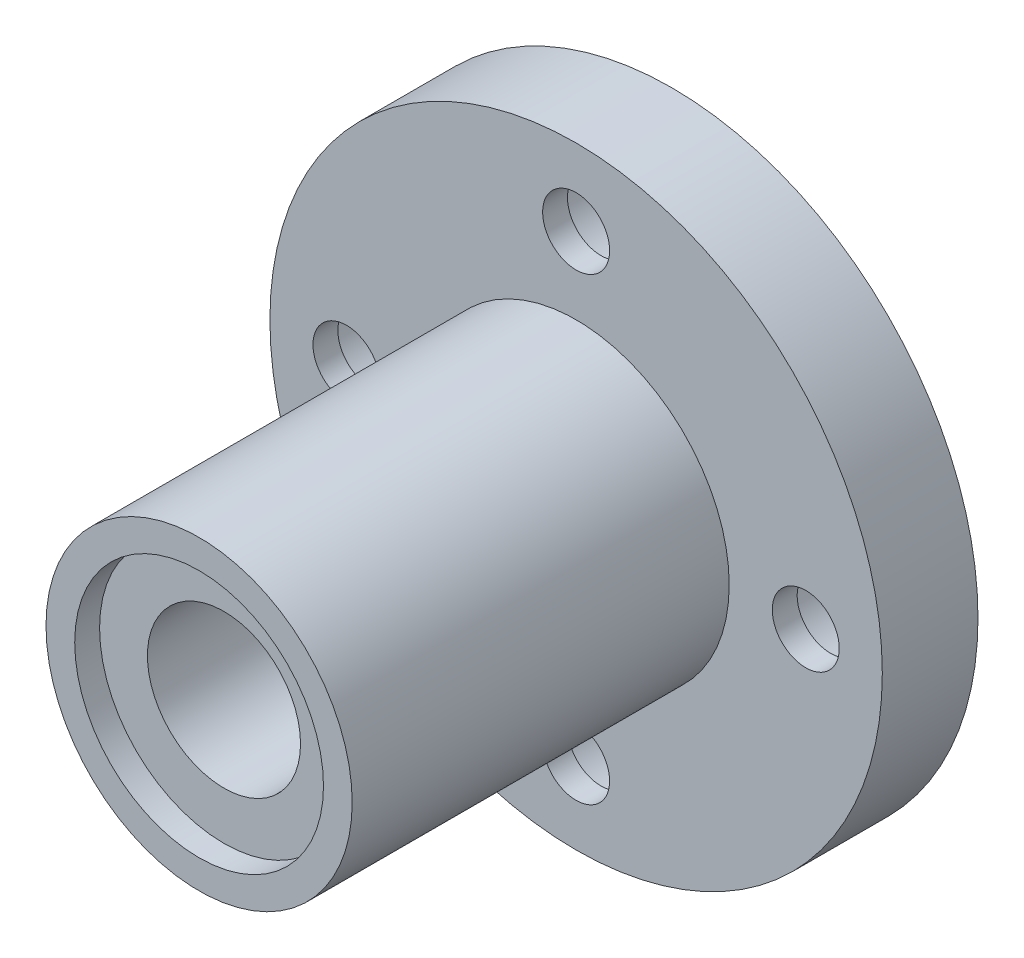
from build123d import *

# Parameters (mm, degrees)
IZIM1_R                     = 16
Y_KSEKLIK_EKSTR_ZYON1_DEPTH = 5
IZIM2_R                     = 8
Y_KSEKLIK_EKSTR_ZYON2_DEPTH = 19.7
KES_EKSTR_ZYON1_REACH       = 35.498
IZIM3_R                     = 4
KES_EKSTR_ZYON2_REACH       = 35.498
IZIM4_R                     = 1.75
IZIM4_3_R                   = 3.25
IZIM4_3_R_2                 = 1.75
KES_EKSTR_ZYON3_DEPTH       = 3.7
IZIM5_R                     = 6.5
KES_EKSTR_ZYON4_DEPTH       = 1.3
KES_EKSTR_ZYON5_START       = -23.4
IZIM5_2_R                   = 6.5
KES_EKSTR_ZYON5_DEPTH       = 1.3


with BuildPart() as part:
    # izim1 → Y_kseklik-Ekstr_zyon1 (new body)
    with BuildSketch(Plane.XY):
        Circle(IZIM1_R)
    extrude(amount=Y_KSEKLIK_EKSTR_ZYON1_DEPTH)

    # izim2 → Y_kseklik-Ekstr_zyon2 (add)
    with BuildSketch(Plane.XY.offset(5)):
        Circle(IZIM2_R)
    extrude(amount=Y_KSEKLIK_EKSTR_ZYON2_DEPTH)

    # izim3 → Kes-Ekstr_zyon1 (cut, up to next)
    with BuildSketch(Plane.XY.offset(24.7), mode=Mode.PRIVATE) as kes_ekstr_zyon1_sk1:
        Circle(IZIM3_R)
    kes_ekstr_zyon1_tool1 = extrude(kes_ekstr_zyon1_sk1.sketch, amount=-KES_EKSTR_ZYON1_REACH, mode=Mode.PRIVATE) & part.part
    add(kes_ekstr_zyon1_tool1.solids().sort_by_distance((0, 0, 24.7))[0], mode=Mode.SUBTRACT)

    # izim4 → Kes-Ekstr_zyon2 (cut, up to next)
    with BuildSketch(Plane(origin=(0, 0, 0), x_dir=(-1, 0, 0), z_dir=(0, 0, -1)), mode=Mode.PRIVATE) as kes_ekstr_zyon2_sk1:
        with Locations((0, 12)):
            Circle(IZIM4_R)
    kes_ekstr_zyon2_tool1 = extrude(kes_ekstr_zyon2_sk1.sketch, amount=-KES_EKSTR_ZYON2_REACH, mode=Mode.PRIVATE) & part.part
    # izim4 → Kes-Ekstr_zyon2 (cut, up to next)
    with BuildSketch(Plane(origin=(0, 0, 0), x_dir=(-1, 0, 0), z_dir=(0, 0, -1)), mode=Mode.PRIVATE) as kes_ekstr_zyon2_sk2:
        with Locations((12, 0)):
            Circle(IZIM4_R)
    kes_ekstr_zyon2_tool2 = extrude(kes_ekstr_zyon2_sk2.sketch, amount=-KES_EKSTR_ZYON2_REACH, mode=Mode.PRIVATE) & part.part
    # izim4 → Kes-Ekstr_zyon2 (cut, up to next)
    with BuildSketch(Plane(origin=(0, 0, 0), x_dir=(-1, 0, 0), z_dir=(0, 0, -1)), mode=Mode.PRIVATE) as kes_ekstr_zyon2_sk3:
        with Locations((0, -12)):
            Circle(IZIM4_R)
    kes_ekstr_zyon2_tool3 = extrude(kes_ekstr_zyon2_sk3.sketch, amount=-KES_EKSTR_ZYON2_REACH, mode=Mode.PRIVATE) & part.part
    # izim4 → Kes-Ekstr_zyon2 (cut, up to next)
    with BuildSketch(Plane(origin=(0, 0, 0), x_dir=(-1, 0, 0), z_dir=(0, 0, -1)), mode=Mode.PRIVATE) as kes_ekstr_zyon2_sk4:
        with Locations((-12, 0)):
            Circle(IZIM4_R)
    kes_ekstr_zyon2_tool4 = extrude(kes_ekstr_zyon2_sk4.sketch, amount=-KES_EKSTR_ZYON2_REACH, mode=Mode.PRIVATE) & part.part
    add(kes_ekstr_zyon2_tool1.solids().sort_by_distance((0, 12, 0))[0], mode=Mode.SUBTRACT)
    add(kes_ekstr_zyon2_tool2.solids().sort_by_distance((-12, 0, 0))[0], mode=Mode.SUBTRACT)
    add(kes_ekstr_zyon2_tool3.solids().sort_by_distance((0, -12, 0))[0], mode=Mode.SUBTRACT)
    add(kes_ekstr_zyon2_tool4.solids().sort_by_distance((12, 0, 0))[0], mode=Mode.SUBTRACT)

    # izim4_3 → Kes-Ekstr_zyon3 (cut)
    # profile 1 of 4: a face of its own
    with BuildSketch(Plane(origin=(0, 0, 0), x_dir=(-1, 0, 0), z_dir=(0, 0, -1))):
        with Locations((0, 12)):
            Circle(IZIM4_3_R)
        with Locations((0, 12)):
            Circle(IZIM4_3_R_2, mode=Mode.SUBTRACT)
    # profile 2 of 4: a face of its own
    with BuildSketch(Plane(origin=(0, 0, 0), x_dir=(-1, 0, 0), z_dir=(0, 0, -1))):
        with Locations((12, 0)):
            Circle(IZIM4_3_R)
        with Locations((12, 0)):
            Circle(IZIM4_3_R_2, mode=Mode.SUBTRACT)
    # profile 3 of 4: a face of its own
    with BuildSketch(Plane(origin=(0, 0, 0), x_dir=(-1, 0, 0), z_dir=(0, 0, -1))):
        with Locations((0, -12)):
            Circle(IZIM4_3_R)
        with Locations((0, -12)):
            Circle(IZIM4_3_R_2, mode=Mode.SUBTRACT)
    # profile 4 of 4: a face of its own
    with BuildSketch(Plane(origin=(0, 0, 0), x_dir=(-1, 0, 0), z_dir=(0, 0, -1))):
        with Locations((-12, 0)):
            Circle(IZIM4_3_R)
        with Locations((-12, 0)):
            Circle(IZIM4_3_R_2, mode=Mode.SUBTRACT)
    extrude(amount=-KES_EKSTR_ZYON3_DEPTH, mode=Mode.SUBTRACT)

    # izim5 → Kes-Ekstr_zyon4 (cut)
    with BuildSketch(Plane.XY.offset(24.7)):
        Circle(IZIM5_R)
    extrude(amount=-KES_EKSTR_ZYON4_DEPTH, mode=Mode.SUBTRACT)

    # izim5_2 → Kes-Ekstr_zyon5 (cut)
    with BuildSketch(Plane.XY.offset(24.7).offset(KES_EKSTR_ZYON5_START)):
        Circle(IZIM5_2_R)
    extrude(amount=-KES_EKSTR_ZYON5_DEPTH, mode=Mode.SUBTRACT)


solid = part.part
